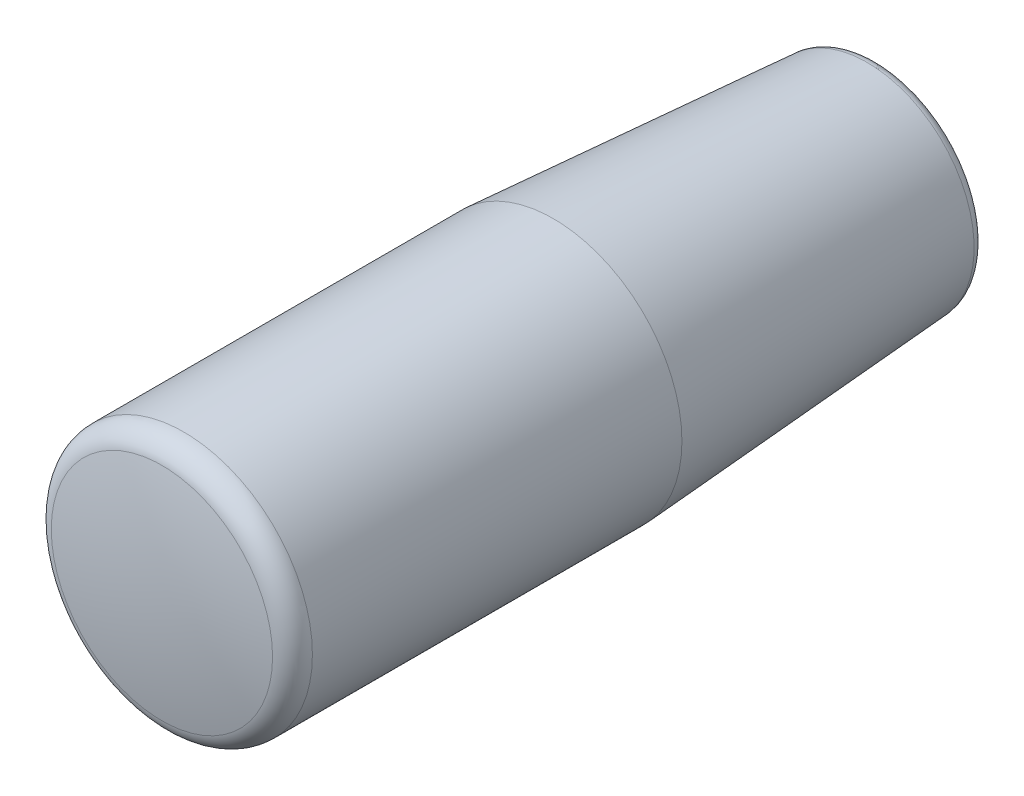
ISO-10303-21;
HEADER;
FILE_DESCRIPTION(('STEP AP214'),'2;1');
FILE_NAME('part.step','',(''),(''),'','','');
FILE_SCHEMA(('AUTOMOTIVE_DESIGN { 1 0 10303 214 1 1 1 1 }'));
ENDSEC;
DATA;
#1=APPLICATION_CONTEXT('core data for automotive mechanical design processes');
#2=APPLICATION_PROTOCOL_DEFINITION('international standard','automotive_design',2000,#1);
#3=PRODUCT_CONTEXT('',#1,'mechanical');
#4=PRODUCT('Part','Part','',(#3));
#5=PRODUCT_RELATED_PRODUCT_CATEGORY('part','',(#4));
#6=PRODUCT_DEFINITION_FORMATION('','',#4);
#7=PRODUCT_DEFINITION_CONTEXT('part definition',#1,'design');
#8=PRODUCT_DEFINITION('design','',#6,#7);
#9=PRODUCT_DEFINITION_SHAPE('','',#8);
#10=(LENGTH_UNIT() NAMED_UNIT(*) SI_UNIT(.MILLI.,.METRE.));
#11=(NAMED_UNIT(*) PLANE_ANGLE_UNIT() SI_UNIT($,.RADIAN.));
#12=(NAMED_UNIT(*) SI_UNIT($,.STERADIAN.) SOLID_ANGLE_UNIT());
#13=UNCERTAINTY_MEASURE_WITH_UNIT(LENGTH_MEASURE(1.E-05),#10,'distance_accuracy_value','');
#14=(GEOMETRIC_REPRESENTATION_CONTEXT(3) GLOBAL_UNCERTAINTY_ASSIGNED_CONTEXT((#13)) GLOBAL_UNIT_ASSIGNED_CONTEXT((#10,
#11,#12)) REPRESENTATION_CONTEXT('',''));
#15=CARTESIAN_POINT('',(0.,0.,0.));
#16=DIRECTION('',(0.,0.,1.));
#17=DIRECTION('',(1.,0.,0.));
#18=AXIS2_PLACEMENT_3D('',#15,#16,#17);
#19=CARTESIAN_POINT('',(0.,0.,-5.));
#20=DIRECTION('',(0.,0.,-1.));
#21=DIRECTION('',(-1.,0.,0.));
#22=AXIS2_PLACEMENT_3D('',#19,#20,#21);
#23=CYLINDRICAL_SURFACE('',#22,11.5);
#24=CARTESIAN_POINT('',(0.,0.,62.0505047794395));
#25=DIRECTION('',(0.,0.,-1.));
#26=DIRECTION('',(-1.,0.,0.));
#27=AXIS2_PLACEMENT_3D('',#24,#25,#26);
#28=CIRCLE('',#27,11.5);
#29=CARTESIAN_POINT('',(-11.5,0.,62.0505047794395));
#30=VERTEX_POINT('',#29);
#31=EDGE_CURVE('E37',#30,#30,#28,.T.);
#32=ORIENTED_EDGE('',*,*,#31,.T.);
#33=EDGE_LOOP('',(#32));
#34=FACE_BOUND('',#33,.T.);
#35=CARTESIAN_POINT('',(0.,0.,29.));
#36=DIRECTION('',(0.,0.,-1.));
#37=DIRECTION('',(-1.,0.,0.));
#38=AXIS2_PLACEMENT_3D('',#35,#36,#37);
#39=CIRCLE('',#38,11.5);
#40=CARTESIAN_POINT('',(-11.5,0.,29.));
#41=VERTEX_POINT('',#40);
#42=EDGE_CURVE('E8',#41,#41,#39,.T.);
#43=ORIENTED_EDGE('',*,*,#42,.F.);
#44=EDGE_LOOP('',(#43));
#45=FACE_BOUND('',#44,.T.);
#46=ADVANCED_FACE('F12',(#34,#45),#23,.T.);
#47=CARTESIAN_POINT('',(0.,0.,0.931197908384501));
#48=DIRECTION('',(0.,0.,1.));
#49=DIRECTION('',(1.,0.,0.));
#50=AXIS2_PLACEMENT_3D('',#47,#48,#49);
#51=CONICAL_SURFACE('',#50,9.56422054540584,0.0688564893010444);
#52=ORIENTED_EDGE('',*,*,#42,.T.);
#53=EDGE_LOOP('',(#52));
#54=FACE_BOUND('',#53,.T.);
#55=CARTESIAN_POINT('',(0.,0.,0.931197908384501));
#56=DIRECTION('',(0.,0.,-1.));
#57=DIRECTION('',(-1.,0.,0.));
#58=AXIS2_PLACEMENT_3D('',#55,#56,#57);
#59=CIRCLE('',#58,9.56422054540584);
#60=CARTESIAN_POINT('',(-9.56422054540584,0.,0.931197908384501));
#61=VERTEX_POINT('',#60);
#62=EDGE_CURVE('E18',#61,#61,#59,.T.);
#63=ORIENTED_EDGE('',*,*,#62,.F.);
#64=EDGE_LOOP('',(#63));
#65=FACE_BOUND('',#64,.T.);
#66=ADVANCED_FACE('F62',(#54,#65),#51,.T.);
#67=CARTESIAN_POINT('',(0.,0.,1.));
#68=DIRECTION('',(0.,0.,-1.));
#69=DIRECTION('',(-1.,0.,0.));
#70=AXIS2_PLACEMENT_3D('',#67,#68,#69);
#71=TOROIDAL_SURFACE('',#70,8.56659021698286,1.);
#72=CARTESIAN_POINT('',(0.,0.,0.));
#73=DIRECTION('',(0.,0.,-1.));
#74=DIRECTION('',(-1.,0.,0.));
#75=AXIS2_PLACEMENT_3D('',#72,#73,#74);
#76=CIRCLE('',#75,8.56659021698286);
#77=CARTESIAN_POINT('',(-8.56659021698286,0.,0.));
#78=VERTEX_POINT('',#77);
#79=EDGE_CURVE('E22',#78,#78,#76,.T.);
#80=ORIENTED_EDGE('',*,*,#79,.F.);
#81=EDGE_LOOP('',(#80));
#82=FACE_BOUND('',#81,.T.);
#83=ORIENTED_EDGE('',*,*,#62,.T.);
#84=EDGE_LOOP('',(#83));
#85=FACE_BOUND('',#84,.T.);
#86=ADVANCED_FACE('F67',(#82,#85),#71,.T.);
#87=CARTESIAN_POINT('',(0.,5.,0.));
#88=DIRECTION('',(0.,0.,-1.));
#89=DIRECTION('',(-1.,0.,0.));
#90=AXIS2_PLACEMENT_3D('',#87,#88,#89);
#91=PLANE('',#90);
#92=ORIENTED_EDGE('',*,*,#79,.T.);
#93=EDGE_LOOP('',(#92));
#94=FACE_BOUND('',#93,.T.);
#95=CARTESIAN_POINT('',(0.,0.,0.));
#96=DIRECTION('',(0.,0.,-1.));
#97=DIRECTION('',(-1.,0.,0.));
#98=AXIS2_PLACEMENT_3D('',#95,#96,#97);
#99=CIRCLE('',#98,5.);
#100=CARTESIAN_POINT('',(-5.,0.,0.));
#101=VERTEX_POINT('',#100);
#102=EDGE_CURVE('E26',#101,#101,#99,.T.);
#103=ORIENTED_EDGE('',*,*,#102,.F.);
#104=EDGE_LOOP('',(#103));
#105=FACE_BOUND('',#104,.T.);
#106=ADVANCED_FACE('F72',(#94,#105),#91,.T.);
#107=CARTESIAN_POINT('',(0.,0.,-5.));
#108=DIRECTION('',(0.,0.,-1.));
#109=DIRECTION('',(-1.,0.,0.));
#110=AXIS2_PLACEMENT_3D('',#107,#108,#109);
#111=CYLINDRICAL_SURFACE('',#110,5.);
#112=CARTESIAN_POINT('',(0.,0.,45.));
#113=DIRECTION('',(0.,0.,-1.));
#114=DIRECTION('',(-1.,0.,0.));
#115=AXIS2_PLACEMENT_3D('',#112,#113,#114);
#116=CIRCLE('',#115,5.);
#117=CARTESIAN_POINT('',(-5.,0.,45.));
#118=VERTEX_POINT('',#117);
#119=EDGE_CURVE('E31',#118,#118,#116,.T.);
#120=ORIENTED_EDGE('',*,*,#119,.F.);
#121=EDGE_LOOP('',(#120));
#122=FACE_BOUND('',#121,.T.);
#123=ORIENTED_EDGE('',*,*,#102,.T.);
#124=EDGE_LOOP('',(#123));
#125=FACE_BOUND('',#124,.T.);
#126=ADVANCED_FACE('F58',(#122,#125),#111,.F.);
#127=CARTESIAN_POINT('',(0.,5.,45.));
#128=DIRECTION('',(0.,0.,1.));
#129=DIRECTION('',(1.,0.,0.));
#130=AXIS2_PLACEMENT_3D('',#127,#128,#129);
#131=PLANE('',#130);
#132=ORIENTED_EDGE('',*,*,#119,.T.);
#133=EDGE_LOOP('',(#132));
#134=FACE_BOUND('',#133,.T.);
#135=ADVANCED_FACE('F51',(#134),#131,.F.);
#136=CARTESIAN_POINT('',(0.,0.,15.));
#137=DIRECTION('',(-1.,0.,0.));
#138=DIRECTION('',(0.,0.,1.));
#139=AXIS2_PLACEMENT_3D('',#136,#137,#138);
#140=SPHERICAL_SURFACE('',#139,50.);
#141=CARTESIAN_POINT('',(0.,0.,15.));
#142=DIRECTION('',(0.,0.,-1.));
#143=DIRECTION('',(-1.,0.,0.));
#144=AXIS2_PLACEMENT_3D('',#141,#142,#143);
#145=SPHERICAL_SURFACE('',#144,50.);
#146=CARTESIAN_POINT('',(0.,0.,64.010942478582));
#147=DIRECTION('',(0.,0.,-1.));
#148=DIRECTION('',(-1.,0.,0.));
#149=AXIS2_PLACEMENT_3D('',#146,#147,#148);
#150=CIRCLE('',#149,9.89583333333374);
#151=CARTESIAN_POINT('',(-9.89583333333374,0.,64.010942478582));
#152=VERTEX_POINT('',#151);
#153=EDGE_CURVE('E34',#152,#152,#150,.T.);
#154=ORIENTED_EDGE('',*,*,#153,.F.);
#155=EDGE_LOOP('',(#154));
#156=FACE_BOUND('',#155,.T.);
#157=ADVANCED_FACE('F46',(#156),#145,.T.);
#158=CARTESIAN_POINT('',(0.,0.,62.0505047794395));
#159=DIRECTION('',(0.,0.,-1.));
#160=DIRECTION('',(-1.,0.,0.));
#161=AXIS2_PLACEMENT_3D('',#158,#159,#160);
#162=TOROIDAL_SURFACE('',#161,9.50000000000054,1.99999999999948);
#163=ORIENTED_EDGE('',*,*,#31,.F.);
#164=EDGE_LOOP('',(#163));
#165=FACE_BOUND('',#164,.T.);
#166=ORIENTED_EDGE('',*,*,#153,.T.);
#167=EDGE_LOOP('',(#166));
#168=FACE_BOUND('',#167,.T.);
#169=ADVANCED_FACE('F43',(#165,#168),#162,.T.);
#170=CLOSED_SHELL('',(#46,#66,#86,#106,#126,#135,#157,#169));
#171=MANIFOLD_SOLID_BREP('B1',#170);
#172=ADVANCED_BREP_SHAPE_REPRESENTATION('',(#18,#171),#14);
#173=SHAPE_DEFINITION_REPRESENTATION(#9,#172);
ENDSEC;
END-ISO-10303-21;
